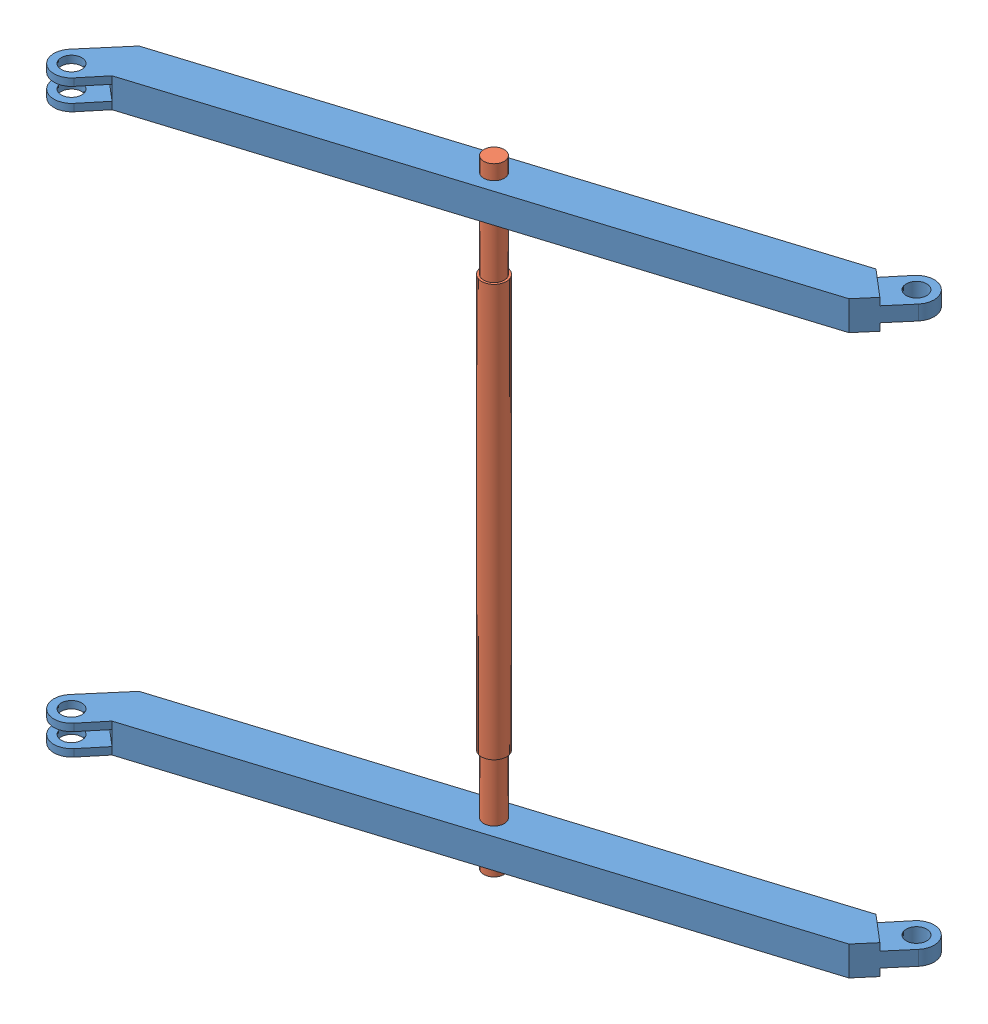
SolidWorks assembly layer_4.SLDASM, configuration Default (file format 11000). Lengths in mm.
Overall size (2311.11 2100 945.79).
3 component instances, 2 part files, 2 mates.
Components (placement in the parent):
- crossarm-1: crossarm.SLDPRT [Default] at (151.3438 950 1380.2057) x (0 1 0) z (0.954527 0 -0.298125) size (100 260 2340)
- crossarm-2: crossarm.SLDPRT [Default] at (151.3438 -950 1380.2057) x (0 1 0) z (0.954527 0 -0.298125) size (100 260 2340)
- cross_rod-1: cross_rod.SLDPRT [Default] at (151.3438 0 1380.2057) x (1 0 0) z (0 1 0) size (85 85 2100)
Mates (geometry in assembly coordinates):
- Concentric1: concentric: cylinder of assembly; cylinder of assembly; cylinder of crossarm-2 through (151.3438 -1000 1380.2057) axis (0 1 0) radius 35; cylinder of cross_rod-1 through (151.3438 1050 1380.2057) axis (0 -1 0) radius 35
- Distance1: distance = 50 mm: plane of assembly; plane of assembly; plane of crossarm-2 through (1085.002 -1000 1015.2642) normal (0 -1 0); plane of cross_rod-1 through (151.3438 -1050 1380.2057) normal (0 -1 0)
